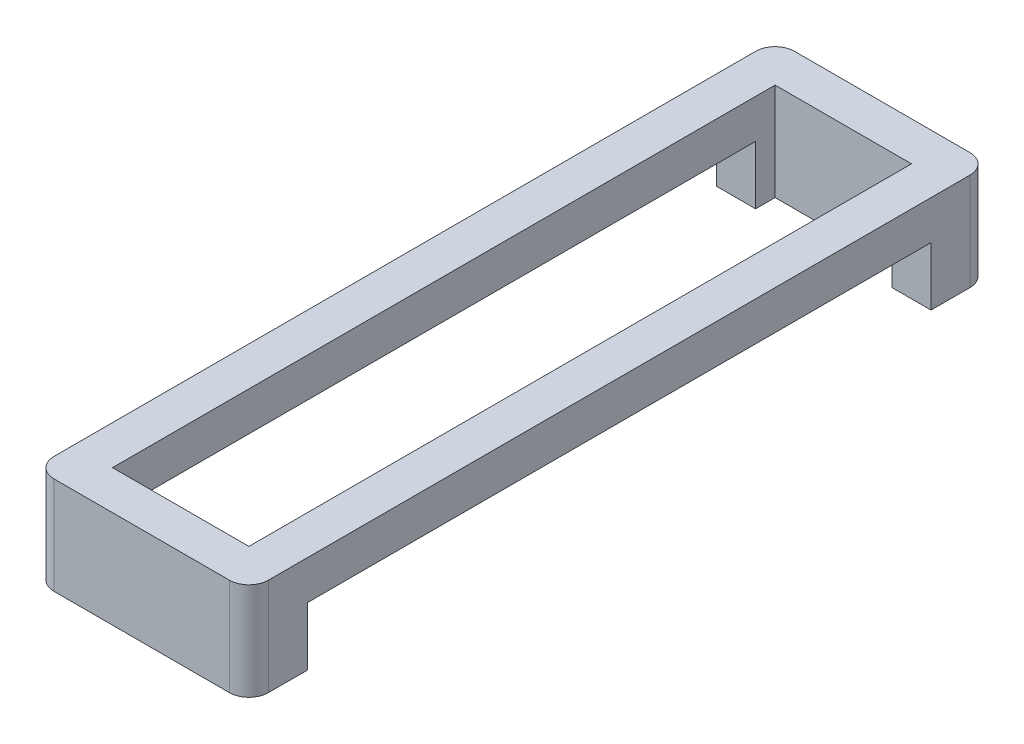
ISO-10303-21;
HEADER;
FILE_DESCRIPTION(('STEP AP214'),'2;1');
FILE_NAME('part.step','',(''),(''),'','','');
FILE_SCHEMA(('AUTOMOTIVE_DESIGN { 1 0 10303 214 1 1 1 1 }'));
ENDSEC;
DATA;
#1=APPLICATION_CONTEXT('core data for automotive mechanical design processes');
#2=APPLICATION_PROTOCOL_DEFINITION('international standard','automotive_design',2000,#1);
#3=PRODUCT_CONTEXT('',#1,'mechanical');
#4=PRODUCT('Part','Part','',(#3));
#5=PRODUCT_RELATED_PRODUCT_CATEGORY('part','',(#4));
#6=PRODUCT_DEFINITION_FORMATION('','',#4);
#7=PRODUCT_DEFINITION_CONTEXT('part definition',#1,'design');
#8=PRODUCT_DEFINITION('design','',#6,#7);
#9=PRODUCT_DEFINITION_SHAPE('','',#8);
#10=(LENGTH_UNIT() NAMED_UNIT(*) SI_UNIT(.MILLI.,.METRE.));
#11=(NAMED_UNIT(*) PLANE_ANGLE_UNIT() SI_UNIT($,.RADIAN.));
#12=(NAMED_UNIT(*) SI_UNIT($,.STERADIAN.) SOLID_ANGLE_UNIT());
#13=UNCERTAINTY_MEASURE_WITH_UNIT(LENGTH_MEASURE(1.E-05),#10,'distance_accuracy_value','');
#14=(GEOMETRIC_REPRESENTATION_CONTEXT(3) GLOBAL_UNCERTAINTY_ASSIGNED_CONTEXT((#13)) GLOBAL_UNIT_ASSIGNED_CONTEXT((#10,
#11,#12)) REPRESENTATION_CONTEXT('',''));
#15=CARTESIAN_POINT('',(0.,0.,0.));
#16=DIRECTION('',(0.,0.,1.));
#17=DIRECTION('',(1.,0.,0.));
#18=AXIS2_PLACEMENT_3D('',#15,#16,#17);
#19=CARTESIAN_POINT('',(-2.25,-2.5,-9.));
#20=DIRECTION('',(0.,1.,0.));
#21=DIRECTION('',(0.,0.,1.));
#22=AXIS2_PLACEMENT_3D('',#19,#20,#21);
#23=PLANE('',#22);
#24=DIRECTION('',(0.,0.,1.));
#25=VECTOR('',#24,1.);
#26=CARTESIAN_POINT('',(-2.75,-2.5,9.));
#27=LINE('',#26,#25);
#28=CARTESIAN_POINT('',(-2.75,-2.5,8.));
#29=VERTEX_POINT('',#28);
#30=CARTESIAN_POINT('',(-2.75,-2.5,9.));
#31=VERTEX_POINT('',#30);
#32=EDGE_CURVE('E267',#29,#31,#27,.T.);
#33=ORIENTED_EDGE('',*,*,#32,.F.);
#34=DIRECTION('',(1.,0.,0.));
#35=VECTOR('',#34,1.);
#36=CARTESIAN_POINT('',(-2.25,-2.5,8.));
#37=LINE('',#36,#35);
#38=CARTESIAN_POINT('',(-1.75,-2.5,8.));
#39=VERTEX_POINT('',#38);
#40=EDGE_CURVE('E199',#29,#39,#37,.T.);
#41=ORIENTED_EDGE('',*,*,#40,.T.);
#42=DIRECTION('',(0.,0.,1.));
#43=VECTOR('',#42,1.);
#44=CARTESIAN_POINT('',(-1.75,-2.5,8.5));
#45=LINE('',#44,#43);
#46=CARTESIAN_POINT('',(-1.75,-2.5,8.5));
#47=VERTEX_POINT('',#46);
#48=EDGE_CURVE('E217',#39,#47,#45,.T.);
#49=ORIENTED_EDGE('',*,*,#48,.T.);
#50=DIRECTION('',(1.,0.,0.));
#51=VECTOR('',#50,1.);
#52=CARTESIAN_POINT('',(-1.75,-2.5,8.5));
#53=LINE('',#52,#51);
#54=CARTESIAN_POINT('',(1.75,-2.5,8.5));
#55=VERTEX_POINT('',#54);
#56=EDGE_CURVE('E221',#47,#55,#53,.T.);
#57=ORIENTED_EDGE('',*,*,#56,.T.);
#58=DIRECTION('',(0.,0.,-1.));
#59=VECTOR('',#58,1.);
#60=CARTESIAN_POINT('',(1.75,-2.5,8.5));
#61=LINE('',#60,#59);
#62=CARTESIAN_POINT('',(1.75,-2.5,8.));
#63=VERTEX_POINT('',#62);
#64=EDGE_CURVE('E225',#55,#63,#61,.T.);
#65=ORIENTED_EDGE('',*,*,#64,.T.);
#66=CARTESIAN_POINT('',(2.75,-2.5,8.));
#67=VERTEX_POINT('',#66);
#68=EDGE_CURVE('E195',#63,#67,#37,.T.);
#69=ORIENTED_EDGE('',*,*,#68,.T.);
#70=DIRECTION('',(0.,0.,-1.));
#71=VECTOR('',#70,1.);
#72=CARTESIAN_POINT('',(2.75,-2.5,9.));
#73=LINE('',#72,#71);
#74=CARTESIAN_POINT('',(2.75,-2.5,9.));
#75=VERTEX_POINT('',#74);
#76=EDGE_CURVE('E279',#75,#67,#73,.T.);
#77=ORIENTED_EDGE('',*,*,#76,.F.);
#78=CARTESIAN_POINT('',(2.25,-2.5,9.));
#79=DIRECTION('',(0.,1.,0.));
#80=DIRECTION('',(0.,0.,1.));
#81=AXIS2_PLACEMENT_3D('',#78,#79,#80);
#82=CIRCLE('',#81,0.5);
#83=CARTESIAN_POINT('',(2.25,-2.5,9.5));
#84=VERTEX_POINT('',#83);
#85=EDGE_CURVE('E275',#84,#75,#82,.T.);
#86=ORIENTED_EDGE('',*,*,#85,.F.);
#87=DIRECTION('',(1.,0.,0.));
#88=VECTOR('',#87,1.);
#89=CARTESIAN_POINT('',(-2.25,-2.5,9.5));
#90=LINE('',#89,#88);
#91=CARTESIAN_POINT('',(-2.25,-2.5,9.5));
#92=VERTEX_POINT('',#91);
#93=EDGE_CURVE('E272',#92,#84,#90,.T.);
#94=ORIENTED_EDGE('',*,*,#93,.F.);
#95=CARTESIAN_POINT('',(-2.25,-2.5,9.));
#96=DIRECTION('',(0.,1.,0.));
#97=DIRECTION('',(0.,0.,-1.));
#98=AXIS2_PLACEMENT_3D('',#95,#96,#97);
#99=CIRCLE('',#98,0.5);
#100=EDGE_CURVE('E269',#31,#92,#99,.T.);
#101=ORIENTED_EDGE('',*,*,#100,.F.);
#102=EDGE_LOOP('',(#33,#41,#49,#57,#65,#69,#77,#86,#94,#101));
#103=FACE_BOUND('',#102,.T.);
#104=ADVANCED_FACE('F27',(#103),#23,.F.);
#105=CARTESIAN_POINT('',(-2.25,-2.5,-9.));
#106=DIRECTION('',(0.,1.,0.));
#107=DIRECTION('',(0.,0.,1.));
#108=AXIS2_PLACEMENT_3D('',#105,#106,#107);
#109=CYLINDRICAL_SURFACE('',#108,0.5);
#110=CARTESIAN_POINT('',(-2.25,0.,-9.));
#111=DIRECTION('',(0.,1.,0.));
#112=DIRECTION('',(0.,0.,1.));
#113=AXIS2_PLACEMENT_3D('',#110,#111,#112);
#114=CIRCLE('',#113,0.5);
#115=CARTESIAN_POINT('',(-2.25,0.,-9.5));
#116=VERTEX_POINT('',#115);
#117=CARTESIAN_POINT('',(-2.75,0.,-9.));
#118=VERTEX_POINT('',#117);
#119=EDGE_CURVE('E234',#116,#118,#114,.T.);
#120=ORIENTED_EDGE('',*,*,#119,.F.);
#121=DIRECTION('',(0.,1.,0.));
#122=VECTOR('',#121,1.);
#123=CARTESIAN_POINT('',(-2.25,-2.5,-9.5));
#124=LINE('',#123,#122);
#125=CARTESIAN_POINT('',(-2.25,-2.5,-9.5));
#126=VERTEX_POINT('',#125);
#127=EDGE_CURVE('E289',#126,#116,#124,.T.);
#128=ORIENTED_EDGE('',*,*,#127,.F.);
#129=CARTESIAN_POINT('',(-2.25,-2.5,-9.));
#130=DIRECTION('',(0.,1.,0.));
#131=DIRECTION('',(0.,0.,1.));
#132=AXIS2_PLACEMENT_3D('',#129,#130,#131);
#133=CIRCLE('',#132,0.5);
#134=CARTESIAN_POINT('',(-2.75,-2.5,-9.));
#135=VERTEX_POINT('',#134);
#136=EDGE_CURVE('E264',#126,#135,#133,.T.);
#137=ORIENTED_EDGE('',*,*,#136,.T.);
#138=DIRECTION('',(0.,1.,0.));
#139=VECTOR('',#138,1.);
#140=CARTESIAN_POINT('',(-2.75,-2.5,-9.));
#141=LINE('',#140,#139);
#142=EDGE_CURVE('E288',#135,#118,#141,.T.);
#143=ORIENTED_EDGE('',*,*,#142,.T.);
#144=EDGE_LOOP('',(#120,#128,#137,#143));
#145=FACE_BOUND('',#144,.T.);
#146=ADVANCED_FACE('F29',(#145),#109,.T.);
#147=CARTESIAN_POINT('',(-2.25,-2.5,-9.5));
#148=DIRECTION('',(0.,0.,-1.));
#149=DIRECTION('',(-1.,0.,0.));
#150=AXIS2_PLACEMENT_3D('',#147,#148,#149);
#151=PLANE('',#150);
#152=DIRECTION('',(-1.,0.,0.));
#153=VECTOR('',#152,1.);
#154=CARTESIAN_POINT('',(-2.25,0.,-9.5));
#155=LINE('',#154,#153);
#156=CARTESIAN_POINT('',(2.25,0.,-9.5));
#157=VERTEX_POINT('',#156);
#158=EDGE_CURVE('E261',#157,#116,#155,.T.);
#159=ORIENTED_EDGE('',*,*,#158,.F.);
#160=DIRECTION('',(0.,1.,0.));
#161=VECTOR('',#160,1.);
#162=CARTESIAN_POINT('',(2.25,-2.5,-9.5));
#163=LINE('',#162,#161);
#164=CARTESIAN_POINT('',(2.25,-2.5,-9.5));
#165=VERTEX_POINT('',#164);
#166=EDGE_CURVE('E292',#165,#157,#163,.T.);
#167=ORIENTED_EDGE('',*,*,#166,.F.);
#168=DIRECTION('',(-1.,0.,0.));
#169=VECTOR('',#168,1.);
#170=CARTESIAN_POINT('',(-2.25,-2.5,-9.5));
#171=LINE('',#170,#169);
#172=EDGE_CURVE('E285',#165,#126,#171,.T.);
#173=ORIENTED_EDGE('',*,*,#172,.T.);
#174=ORIENTED_EDGE('',*,*,#127,.T.);
#175=EDGE_LOOP('',(#159,#167,#173,#174));
#176=FACE_BOUND('',#175,.T.);
#177=ADVANCED_FACE('F365',(#176),#151,.T.);
#178=CARTESIAN_POINT('',(2.25,-2.5,-9.));
#179=DIRECTION('',(0.,1.,0.));
#180=DIRECTION('',(0.,0.,1.));
#181=AXIS2_PLACEMENT_3D('',#178,#179,#180);
#182=CYLINDRICAL_SURFACE('',#181,0.5);
#183=CARTESIAN_POINT('',(2.25,0.,-9.));
#184=DIRECTION('',(0.,1.,0.));
#185=DIRECTION('',(0.,0.,1.));
#186=AXIS2_PLACEMENT_3D('',#183,#184,#185);
#187=CIRCLE('',#186,0.5);
#188=CARTESIAN_POINT('',(2.75,0.,-9.));
#189=VERTEX_POINT('',#188);
#190=EDGE_CURVE('E258',#189,#157,#187,.T.);
#191=ORIENTED_EDGE('',*,*,#190,.F.);
#192=DIRECTION('',(0.,1.,0.));
#193=VECTOR('',#192,1.);
#194=CARTESIAN_POINT('',(2.75,-2.5,-9.));
#195=LINE('',#194,#193);
#196=CARTESIAN_POINT('',(2.75,-2.5,-9.));
#197=VERTEX_POINT('',#196);
#198=EDGE_CURVE('E294',#197,#189,#195,.T.);
#199=ORIENTED_EDGE('',*,*,#198,.F.);
#200=CARTESIAN_POINT('',(2.25,-2.5,-9.));
#201=DIRECTION('',(0.,1.,0.));
#202=DIRECTION('',(0.,0.,1.));
#203=AXIS2_PLACEMENT_3D('',#200,#201,#202);
#204=CIRCLE('',#203,0.5);
#205=EDGE_CURVE('E282',#197,#165,#204,.T.);
#206=ORIENTED_EDGE('',*,*,#205,.T.);
#207=ORIENTED_EDGE('',*,*,#166,.T.);
#208=EDGE_LOOP('',(#191,#199,#206,#207));
#209=FACE_BOUND('',#208,.T.);
#210=ADVANCED_FACE('F369',(#209),#182,.T.);
#211=CARTESIAN_POINT('',(2.75,-2.5,9.));
#212=DIRECTION('',(1.,0.,0.));
#213=DIRECTION('',(0.,0.,-1.));
#214=AXIS2_PLACEMENT_3D('',#211,#212,#213);
#215=PLANE('',#214);
#216=DIRECTION('',(0.,-1.,0.));
#217=VECTOR('',#216,1.);
#218=CARTESIAN_POINT('',(2.75,-2.5,8.));
#219=LINE('',#218,#217);
#220=CARTESIAN_POINT('',(2.75,-1.,8.));
#221=VERTEX_POINT('',#220);
#222=EDGE_CURVE('E198',#221,#67,#219,.T.);
#223=ORIENTED_EDGE('',*,*,#222,.F.);
#224=DIRECTION('',(0.,0.,1.));
#225=VECTOR('',#224,1.);
#226=CARTESIAN_POINT('',(2.75,-1.,9.));
#227=LINE('',#226,#225);
#228=CARTESIAN_POINT('',(2.75,-0.999999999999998,-8.));
#229=VERTEX_POINT('',#228);
#230=EDGE_CURVE('E175',#229,#221,#227,.T.);
#231=ORIENTED_EDGE('',*,*,#230,.F.);
#232=DIRECTION('',(0.,1.,0.));
#233=VECTOR('',#232,1.);
#234=CARTESIAN_POINT('',(2.75,-2.5,-8.));
#235=LINE('',#234,#233);
#236=CARTESIAN_POINT('',(2.75,-2.5,-8.));
#237=VERTEX_POINT('',#236);
#238=EDGE_CURVE('E319',#237,#229,#235,.T.);
#239=ORIENTED_EDGE('',*,*,#238,.F.);
#240=EDGE_CURVE('E278',#237,#197,#73,.T.);
#241=ORIENTED_EDGE('',*,*,#240,.T.);
#242=ORIENTED_EDGE('',*,*,#198,.T.);
#243=DIRECTION('',(0.,0.,-1.));
#244=VECTOR('',#243,1.);
#245=CARTESIAN_POINT('',(2.75,0.,9.));
#246=LINE('',#245,#244);
#247=CARTESIAN_POINT('',(2.75,0.,9.));
#248=VERTEX_POINT('',#247);
#249=EDGE_CURVE('E255',#248,#189,#246,.T.);
#250=ORIENTED_EDGE('',*,*,#249,.F.);
#251=DIRECTION('',(0.,1.,0.));
#252=VECTOR('',#251,1.);
#253=CARTESIAN_POINT('',(2.75,-2.5,9.));
#254=LINE('',#253,#252);
#255=EDGE_CURVE('E296',#75,#248,#254,.T.);
#256=ORIENTED_EDGE('',*,*,#255,.F.);
#257=ORIENTED_EDGE('',*,*,#76,.T.);
#258=EDGE_LOOP('',(#223,#231,#239,#241,#242,#250,#256,#257));
#259=FACE_BOUND('',#258,.T.);
#260=ADVANCED_FACE('F371',(#259),#215,.T.);
#261=CARTESIAN_POINT('',(2.25,-2.5,9.));
#262=DIRECTION('',(0.,1.,0.));
#263=DIRECTION('',(0.,0.,1.));
#264=AXIS2_PLACEMENT_3D('',#261,#262,#263);
#265=CYLINDRICAL_SURFACE('',#264,0.5);
#266=CARTESIAN_POINT('',(2.25,0.,9.));
#267=DIRECTION('',(0.,1.,0.));
#268=DIRECTION('',(0.,0.,1.));
#269=AXIS2_PLACEMENT_3D('',#266,#267,#268);
#270=CIRCLE('',#269,0.5);
#271=CARTESIAN_POINT('',(2.25,0.,9.5));
#272=VERTEX_POINT('',#271);
#273=EDGE_CURVE('E252',#272,#248,#270,.T.);
#274=ORIENTED_EDGE('',*,*,#273,.F.);
#275=DIRECTION('',(0.,1.,0.));
#276=VECTOR('',#275,1.);
#277=CARTESIAN_POINT('',(2.25,-2.5,9.5));
#278=LINE('',#277,#276);
#279=EDGE_CURVE('E298',#84,#272,#278,.T.);
#280=ORIENTED_EDGE('',*,*,#279,.F.);
#281=ORIENTED_EDGE('',*,*,#85,.T.);
#282=ORIENTED_EDGE('',*,*,#255,.T.);
#283=EDGE_LOOP('',(#274,#280,#281,#282));
#284=FACE_BOUND('',#283,.T.);
#285=ADVANCED_FACE('F377',(#284),#265,.T.);
#286=CARTESIAN_POINT('',(-2.25,-2.5,9.5));
#287=DIRECTION('',(0.,0.,1.));
#288=DIRECTION('',(1.,0.,0.));
#289=AXIS2_PLACEMENT_3D('',#286,#287,#288);
#290=PLANE('',#289);
#291=DIRECTION('',(1.,0.,0.));
#292=VECTOR('',#291,1.);
#293=CARTESIAN_POINT('',(-2.25,0.,9.5));
#294=LINE('',#293,#292);
#295=CARTESIAN_POINT('',(-2.25,0.,9.5));
#296=VERTEX_POINT('',#295);
#297=EDGE_CURVE('E249',#296,#272,#294,.T.);
#298=ORIENTED_EDGE('',*,*,#297,.F.);
#299=DIRECTION('',(0.,1.,0.));
#300=VECTOR('',#299,1.);
#301=CARTESIAN_POINT('',(-2.25,-2.5,9.5));
#302=LINE('',#301,#300);
#303=EDGE_CURVE('E300',#92,#296,#302,.T.);
#304=ORIENTED_EDGE('',*,*,#303,.F.);
#305=ORIENTED_EDGE('',*,*,#93,.T.);
#306=ORIENTED_EDGE('',*,*,#279,.T.);
#307=EDGE_LOOP('',(#298,#304,#305,#306));
#308=FACE_BOUND('',#307,.T.);
#309=ADVANCED_FACE('F379',(#308),#290,.T.);
#310=CARTESIAN_POINT('',(-2.25,-2.5,9.));
#311=DIRECTION('',(0.,1.,0.));
#312=DIRECTION('',(0.,0.,1.));
#313=AXIS2_PLACEMENT_3D('',#310,#311,#312);
#314=CYLINDRICAL_SURFACE('',#313,0.5);
#315=CARTESIAN_POINT('',(-2.25,0.,9.));
#316=DIRECTION('',(0.,1.,0.));
#317=DIRECTION('',(0.,0.,-1.));
#318=AXIS2_PLACEMENT_3D('',#315,#316,#317);
#319=CIRCLE('',#318,0.5);
#320=CARTESIAN_POINT('',(-2.75,0.,9.));
#321=VERTEX_POINT('',#320);
#322=EDGE_CURVE('E246',#321,#296,#319,.T.);
#323=ORIENTED_EDGE('',*,*,#322,.F.);
#324=DIRECTION('',(0.,1.,0.));
#325=VECTOR('',#324,1.);
#326=CARTESIAN_POINT('',(-2.75,-2.5,9.));
#327=LINE('',#326,#325);
#328=EDGE_CURVE('E302',#31,#321,#327,.T.);
#329=ORIENTED_EDGE('',*,*,#328,.F.);
#330=ORIENTED_EDGE('',*,*,#100,.T.);
#331=ORIENTED_EDGE('',*,*,#303,.T.);
#332=EDGE_LOOP('',(#323,#329,#330,#331));
#333=FACE_BOUND('',#332,.T.);
#334=ADVANCED_FACE('F355',(#333),#314,.T.);
#335=CARTESIAN_POINT('',(-2.75,-2.5,9.));
#336=DIRECTION('',(-1.,0.,0.));
#337=DIRECTION('',(0.,0.,1.));
#338=AXIS2_PLACEMENT_3D('',#335,#336,#337);
#339=PLANE('',#338);
#340=DIRECTION('',(0.,1.,0.));
#341=VECTOR('',#340,1.);
#342=CARTESIAN_POINT('',(-2.75,-2.5,8.));
#343=LINE('',#342,#341);
#344=CARTESIAN_POINT('',(-2.75,-1.,8.));
#345=VERTEX_POINT('',#344);
#346=EDGE_CURVE('E204',#29,#345,#343,.T.);
#347=ORIENTED_EDGE('',*,*,#346,.F.);
#348=ORIENTED_EDGE('',*,*,#32,.T.);
#349=ORIENTED_EDGE('',*,*,#328,.T.);
#350=DIRECTION('',(0.,0.,1.));
#351=VECTOR('',#350,1.);
#352=CARTESIAN_POINT('',(-2.75,0.,9.));
#353=LINE('',#352,#351);
#354=EDGE_CURVE('E243',#118,#321,#353,.T.);
#355=ORIENTED_EDGE('',*,*,#354,.F.);
#356=ORIENTED_EDGE('',*,*,#142,.F.);
#357=CARTESIAN_POINT('',(-2.75,-2.5,-8.));
#358=VERTEX_POINT('',#357);
#359=EDGE_CURVE('E186',#135,#358,#27,.T.);
#360=ORIENTED_EDGE('',*,*,#359,.T.);
#361=DIRECTION('',(0.,-1.,0.));
#362=VECTOR('',#361,1.);
#363=CARTESIAN_POINT('',(-2.75,-2.5,-8.));
#364=LINE('',#363,#362);
#365=CARTESIAN_POINT('',(-2.75,-0.999999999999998,-8.));
#366=VERTEX_POINT('',#365);
#367=EDGE_CURVE('E179',#366,#358,#364,.T.);
#368=ORIENTED_EDGE('',*,*,#367,.F.);
#369=DIRECTION('',(0.,0.,-1.));
#370=VECTOR('',#369,1.);
#371=CARTESIAN_POINT('',(-2.75,-1.,9.));
#372=LINE('',#371,#370);
#373=EDGE_CURVE('E165',#345,#366,#372,.T.);
#374=ORIENTED_EDGE('',*,*,#373,.F.);
#375=EDGE_LOOP('',(#347,#348,#349,#355,#356,#360,#368,#374));
#376=FACE_BOUND('',#375,.T.);
#377=ADVANCED_FACE('F184',(#376),#339,.T.);
#378=ORIENTED_EDGE('',*,*,#240,.F.);
#379=DIRECTION('',(-1.,0.,0.));
#380=VECTOR('',#379,1.);
#381=CARTESIAN_POINT('',(-2.25,-2.5,-8.));
#382=LINE('',#381,#380);
#383=CARTESIAN_POINT('',(1.75,-2.5,-8.));
#384=VERTEX_POINT('',#383);
#385=EDGE_CURVE('E190',#237,#384,#382,.T.);
#386=ORIENTED_EDGE('',*,*,#385,.T.);
#387=CARTESIAN_POINT('',(1.75,-2.5,-8.5));
#388=VERTEX_POINT('',#387);
#389=EDGE_CURVE('E224',#384,#388,#61,.T.);
#390=ORIENTED_EDGE('',*,*,#389,.T.);
#391=DIRECTION('',(-1.,0.,0.));
#392=VECTOR('',#391,1.);
#393=CARTESIAN_POINT('',(-1.75,-2.5,-8.5));
#394=LINE('',#393,#392);
#395=CARTESIAN_POINT('',(-1.75,-2.5,-8.5));
#396=VERTEX_POINT('',#395);
#397=EDGE_CURVE('E228',#388,#396,#394,.T.);
#398=ORIENTED_EDGE('',*,*,#397,.T.);
#399=CARTESIAN_POINT('',(-1.75,-2.5,-8.));
#400=VERTEX_POINT('',#399);
#401=EDGE_CURVE('E218',#396,#400,#45,.T.);
#402=ORIENTED_EDGE('',*,*,#401,.T.);
#403=EDGE_CURVE('E42',#400,#358,#382,.T.);
#404=ORIENTED_EDGE('',*,*,#403,.T.);
#405=ORIENTED_EDGE('',*,*,#359,.F.);
#406=ORIENTED_EDGE('',*,*,#136,.F.);
#407=ORIENTED_EDGE('',*,*,#172,.F.);
#408=ORIENTED_EDGE('',*,*,#205,.F.);
#409=EDGE_LOOP('',(#378,#386,#390,#398,#402,#404,#405,#406,#407,#408));
#410=FACE_BOUND('',#409,.T.);
#411=ADVANCED_FACE('F327',(#410),#23,.F.);
#412=CARTESIAN_POINT('',(-2.25,0.,-9.));
#413=DIRECTION('',(0.,1.,0.));
#414=DIRECTION('',(0.,0.,1.));
#415=AXIS2_PLACEMENT_3D('',#412,#413,#414);
#416=PLANE('',#415);
#417=DIRECTION('',(0.,0.,1.));
#418=VECTOR('',#417,1.);
#419=CARTESIAN_POINT('',(-1.75,0.,8.5));
#420=LINE('',#419,#418);
#421=CARTESIAN_POINT('',(-1.75,0.,-8.5));
#422=VERTEX_POINT('',#421);
#423=CARTESIAN_POINT('',(-1.75,0.,8.5));
#424=VERTEX_POINT('',#423);
#425=EDGE_CURVE('E206',#422,#424,#420,.T.);
#426=ORIENTED_EDGE('',*,*,#425,.F.);
#427=DIRECTION('',(-1.,0.,0.));
#428=VECTOR('',#427,1.);
#429=CARTESIAN_POINT('',(-1.75,0.,-8.5));
#430=LINE('',#429,#428);
#431=CARTESIAN_POINT('',(1.75,0.,-8.5));
#432=VERTEX_POINT('',#431);
#433=EDGE_CURVE('E214',#432,#422,#430,.T.);
#434=ORIENTED_EDGE('',*,*,#433,.F.);
#435=DIRECTION('',(0.,0.,-1.));
#436=VECTOR('',#435,1.);
#437=CARTESIAN_POINT('',(1.75,0.,8.5));
#438=LINE('',#437,#436);
#439=CARTESIAN_POINT('',(1.75,0.,8.5));
#440=VERTEX_POINT('',#439);
#441=EDGE_CURVE('E211',#440,#432,#438,.T.);
#442=ORIENTED_EDGE('',*,*,#441,.F.);
#443=DIRECTION('',(1.,0.,0.));
#444=VECTOR('',#443,1.);
#445=CARTESIAN_POINT('',(-1.75,0.,8.5));
#446=LINE('',#445,#444);
#447=EDGE_CURVE('E208',#424,#440,#446,.T.);
#448=ORIENTED_EDGE('',*,*,#447,.F.);
#449=EDGE_LOOP('',(#426,#434,#442,#448));
#450=FACE_BOUND('',#449,.T.);
#451=ORIENTED_EDGE('',*,*,#119,.T.);
#452=ORIENTED_EDGE('',*,*,#354,.T.);
#453=ORIENTED_EDGE('',*,*,#322,.T.);
#454=ORIENTED_EDGE('',*,*,#297,.T.);
#455=ORIENTED_EDGE('',*,*,#273,.T.);
#456=ORIENTED_EDGE('',*,*,#249,.T.);
#457=ORIENTED_EDGE('',*,*,#190,.T.);
#458=ORIENTED_EDGE('',*,*,#158,.T.);
#459=EDGE_LOOP('',(#451,#452,#453,#454,#455,#456,#457,#458));
#460=FACE_BOUND('',#459,.T.);
#461=ADVANCED_FACE('F342',(#450,#460),#416,.T.);
#462=CARTESIAN_POINT('',(-1.75,-2.5,8.5));
#463=DIRECTION('',(-1.,0.,0.));
#464=DIRECTION('',(0.,0.,1.));
#465=AXIS2_PLACEMENT_3D('',#462,#463,#464);
#466=PLANE('',#465);
#467=ORIENTED_EDGE('',*,*,#48,.F.);
#468=DIRECTION('',(0.,1.,0.));
#469=VECTOR('',#468,1.);
#470=CARTESIAN_POINT('',(-1.75,-2.5,8.));
#471=LINE('',#470,#469);
#472=CARTESIAN_POINT('',(-1.75,-1.,8.));
#473=VERTEX_POINT('',#472);
#474=EDGE_CURVE('E201',#39,#473,#471,.T.);
#475=ORIENTED_EDGE('',*,*,#474,.T.);
#476=DIRECTION('',(0.,0.,-1.));
#477=VECTOR('',#476,1.);
#478=CARTESIAN_POINT('',(-1.75,-1.,8.5));
#479=LINE('',#478,#477);
#480=CARTESIAN_POINT('',(-1.75,-0.999999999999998,-8.));
#481=VERTEX_POINT('',#480);
#482=EDGE_CURVE('E176',#473,#481,#479,.T.);
#483=ORIENTED_EDGE('',*,*,#482,.T.);
#484=DIRECTION('',(0.,-1.,0.));
#485=VECTOR('',#484,1.);
#486=CARTESIAN_POINT('',(-1.75,-2.5,-8.));
#487=LINE('',#486,#485);
#488=EDGE_CURVE('E180',#481,#400,#487,.T.);
#489=ORIENTED_EDGE('',*,*,#488,.T.);
#490=ORIENTED_EDGE('',*,*,#401,.F.);
#491=DIRECTION('',(0.,1.,0.));
#492=VECTOR('',#491,1.);
#493=CARTESIAN_POINT('',(-1.75,-2.5,-8.5));
#494=LINE('',#493,#492);
#495=EDGE_CURVE('E232',#396,#422,#494,.T.);
#496=ORIENTED_EDGE('',*,*,#495,.T.);
#497=ORIENTED_EDGE('',*,*,#425,.T.);
#498=DIRECTION('',(0.,1.,0.));
#499=VECTOR('',#498,1.);
#500=CARTESIAN_POINT('',(-1.75,-2.5,8.5));
#501=LINE('',#500,#499);
#502=EDGE_CURVE('E231',#47,#424,#501,.T.);
#503=ORIENTED_EDGE('',*,*,#502,.F.);
#504=EDGE_LOOP('',(#467,#475,#483,#489,#490,#496,#497,#503));
#505=FACE_BOUND('',#504,.T.);
#506=ADVANCED_FACE('F324',(#505),#466,.F.);
#507=CARTESIAN_POINT('',(-1.75,-2.5,-8.5));
#508=DIRECTION('',(0.,0.,-1.));
#509=DIRECTION('',(-1.,0.,0.));
#510=AXIS2_PLACEMENT_3D('',#507,#508,#509);
#511=PLANE('',#510);
#512=ORIENTED_EDGE('',*,*,#433,.T.);
#513=ORIENTED_EDGE('',*,*,#495,.F.);
#514=ORIENTED_EDGE('',*,*,#397,.F.);
#515=DIRECTION('',(0.,1.,0.));
#516=VECTOR('',#515,1.);
#517=CARTESIAN_POINT('',(1.75,-2.5,-8.5));
#518=LINE('',#517,#516);
#519=EDGE_CURVE('E235',#388,#432,#518,.T.);
#520=ORIENTED_EDGE('',*,*,#519,.T.);
#521=EDGE_LOOP('',(#512,#513,#514,#520));
#522=FACE_BOUND('',#521,.T.);
#523=ADVANCED_FACE('F331',(#522),#511,.F.);
#524=CARTESIAN_POINT('',(1.75,-2.5,8.5));
#525=DIRECTION('',(1.,0.,0.));
#526=DIRECTION('',(0.,0.,-1.));
#527=AXIS2_PLACEMENT_3D('',#524,#525,#526);
#528=PLANE('',#527);
#529=DIRECTION('',(0.,0.,1.));
#530=VECTOR('',#529,1.);
#531=CARTESIAN_POINT('',(1.75,-1.,8.5));
#532=LINE('',#531,#530);
#533=CARTESIAN_POINT('',(1.75,-0.999999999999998,-8.));
#534=VERTEX_POINT('',#533);
#535=CARTESIAN_POINT('',(1.75,-1.,8.));
#536=VERTEX_POINT('',#535);
#537=EDGE_CURVE('E35',#534,#536,#532,.T.);
#538=ORIENTED_EDGE('',*,*,#537,.T.);
#539=DIRECTION('',(0.,-1.,0.));
#540=VECTOR('',#539,1.);
#541=CARTESIAN_POINT('',(1.75,-2.5,8.));
#542=LINE('',#541,#540);
#543=EDGE_CURVE('E11',#536,#63,#542,.T.);
#544=ORIENTED_EDGE('',*,*,#543,.T.);
#545=ORIENTED_EDGE('',*,*,#64,.F.);
#546=DIRECTION('',(0.,1.,0.));
#547=VECTOR('',#546,1.);
#548=CARTESIAN_POINT('',(1.75,-2.5,8.5));
#549=LINE('',#548,#547);
#550=EDGE_CURVE('E237',#55,#440,#549,.T.);
#551=ORIENTED_EDGE('',*,*,#550,.T.);
#552=ORIENTED_EDGE('',*,*,#441,.T.);
#553=ORIENTED_EDGE('',*,*,#519,.F.);
#554=ORIENTED_EDGE('',*,*,#389,.F.);
#555=DIRECTION('',(0.,1.,0.));
#556=VECTOR('',#555,1.);
#557=CARTESIAN_POINT('',(1.75,-2.5,-8.));
#558=LINE('',#557,#556);
#559=EDGE_CURVE('E291',#384,#534,#558,.T.);
#560=ORIENTED_EDGE('',*,*,#559,.T.);
#561=EDGE_LOOP('',(#538,#544,#545,#551,#552,#553,#554,#560));
#562=FACE_BOUND('',#561,.T.);
#563=ADVANCED_FACE('F308',(#562),#528,.F.);
#564=CARTESIAN_POINT('',(-1.75,-2.5,8.5));
#565=DIRECTION('',(0.,0.,1.));
#566=DIRECTION('',(1.,0.,0.));
#567=AXIS2_PLACEMENT_3D('',#564,#565,#566);
#568=PLANE('',#567);
#569=ORIENTED_EDGE('',*,*,#447,.T.);
#570=ORIENTED_EDGE('',*,*,#550,.F.);
#571=ORIENTED_EDGE('',*,*,#56,.F.);
#572=ORIENTED_EDGE('',*,*,#502,.T.);
#573=EDGE_LOOP('',(#569,#570,#571,#572));
#574=FACE_BOUND('',#573,.T.);
#575=ADVANCED_FACE('F339',(#574),#568,.F.);
#576=CARTESIAN_POINT('',(-6.25,-4.97834824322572,-8.));
#577=DIRECTION('',(0.,0.,-1.));
#578=DIRECTION('',(-1.,0.,0.));
#579=AXIS2_PLACEMENT_3D('',#576,#577,#578);
#580=PLANE('',#579);
#581=ORIENTED_EDGE('',*,*,#238,.T.);
#582=DIRECTION('',(1.,0.,0.));
#583=VECTOR('',#582,1.);
#584=CARTESIAN_POINT('',(-6.25,-0.999999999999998,-8.));
#585=LINE('',#584,#583);
#586=EDGE_CURVE('E50',#534,#229,#585,.T.);
#587=ORIENTED_EDGE('',*,*,#586,.F.);
#588=ORIENTED_EDGE('',*,*,#559,.F.);
#589=ORIENTED_EDGE('',*,*,#385,.F.);
#590=EDGE_LOOP('',(#581,#587,#588,#589));
#591=FACE_BOUND('',#590,.T.);
#592=ADVANCED_FACE('F441',(#591),#580,.F.);
#593=CARTESIAN_POINT('',(-6.25,-1.,8.));
#594=DIRECTION('',(0.,1.,0.));
#595=DIRECTION('',(0.,0.,1.));
#596=AXIS2_PLACEMENT_3D('',#593,#594,#595);
#597=PLANE('',#596);
#598=ORIENTED_EDGE('',*,*,#230,.T.);
#599=DIRECTION('',(1.,0.,0.));
#600=VECTOR('',#599,1.);
#601=CARTESIAN_POINT('',(-6.25,-1.,8.));
#602=LINE('',#601,#600);
#603=EDGE_CURVE('E181',#536,#221,#602,.T.);
#604=ORIENTED_EDGE('',*,*,#603,.F.);
#605=ORIENTED_EDGE('',*,*,#537,.F.);
#606=ORIENTED_EDGE('',*,*,#586,.T.);
#607=EDGE_LOOP('',(#598,#604,#605,#606));
#608=FACE_BOUND('',#607,.T.);
#609=ADVANCED_FACE('F312',(#608),#597,.F.);
#610=CARTESIAN_POINT('',(-6.25,-4.97834824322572,8.));
#611=DIRECTION('',(0.,0.,1.));
#612=DIRECTION('',(1.,0.,0.));
#613=AXIS2_PLACEMENT_3D('',#610,#611,#612);
#614=PLANE('',#613);
#615=ORIENTED_EDGE('',*,*,#222,.T.);
#616=ORIENTED_EDGE('',*,*,#68,.F.);
#617=ORIENTED_EDGE('',*,*,#543,.F.);
#618=ORIENTED_EDGE('',*,*,#603,.T.);
#619=EDGE_LOOP('',(#615,#616,#617,#618));
#620=FACE_BOUND('',#619,.T.);
#621=ADVANCED_FACE('F374',(#620),#614,.F.);
#622=ORIENTED_EDGE('',*,*,#346,.T.);
#623=EDGE_CURVE('E171',#345,#473,#602,.T.);
#624=ORIENTED_EDGE('',*,*,#623,.T.);
#625=ORIENTED_EDGE('',*,*,#474,.F.);
#626=ORIENTED_EDGE('',*,*,#40,.F.);
#627=EDGE_LOOP('',(#622,#624,#625,#626));
#628=FACE_BOUND('',#627,.T.);
#629=ADVANCED_FACE('F348',(#628),#614,.F.);
#630=ORIENTED_EDGE('',*,*,#373,.T.);
#631=EDGE_CURVE('E168',#366,#481,#585,.T.);
#632=ORIENTED_EDGE('',*,*,#631,.T.);
#633=ORIENTED_EDGE('',*,*,#482,.F.);
#634=ORIENTED_EDGE('',*,*,#623,.F.);
#635=EDGE_LOOP('',(#630,#632,#633,#634));
#636=FACE_BOUND('',#635,.T.);
#637=ADVANCED_FACE('F167',(#636),#597,.F.);
#638=ORIENTED_EDGE('',*,*,#367,.T.);
#639=ORIENTED_EDGE('',*,*,#403,.F.);
#640=ORIENTED_EDGE('',*,*,#488,.F.);
#641=ORIENTED_EDGE('',*,*,#631,.F.);
#642=EDGE_LOOP('',(#638,#639,#640,#641));
#643=FACE_BOUND('',#642,.T.);
#644=ADVANCED_FACE('F178',(#643),#580,.F.);
#645=CLOSED_SHELL('',(#104,#146,#177,#210,#260,#285,#309,#334,#377,#411,#461,#506,#523,#563,
#575,#592,#609,#621,#629,#637,#644));
#646=MANIFOLD_SOLID_BREP('B2',#645);
#647=ADVANCED_BREP_SHAPE_REPRESENTATION('',(#18,#646),#14);
#648=SHAPE_DEFINITION_REPRESENTATION(#9,#647);
ENDSEC;
END-ISO-10303-21;
